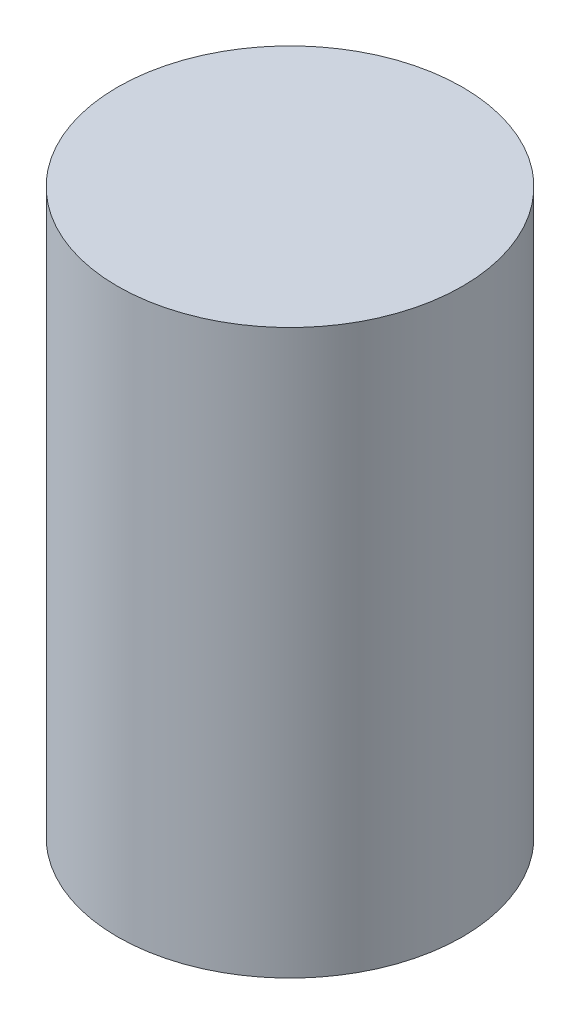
ISO-10303-21;
HEADER;
FILE_DESCRIPTION(('STEP AP214'),'2;1');
FILE_NAME('part.step','',(''),(''),'','','');
FILE_SCHEMA(('AUTOMOTIVE_DESIGN { 1 0 10303 214 1 1 1 1 }'));
ENDSEC;
DATA;
#1=APPLICATION_CONTEXT('core data for automotive mechanical design processes');
#2=APPLICATION_PROTOCOL_DEFINITION('international standard','automotive_design',2000,#1);
#3=PRODUCT_CONTEXT('',#1,'mechanical');
#4=PRODUCT('Part','Part','',(#3));
#5=PRODUCT_RELATED_PRODUCT_CATEGORY('part','',(#4));
#6=PRODUCT_DEFINITION_FORMATION('','',#4);
#7=PRODUCT_DEFINITION_CONTEXT('part definition',#1,'design');
#8=PRODUCT_DEFINITION('design','',#6,#7);
#9=PRODUCT_DEFINITION_SHAPE('','',#8);
#10=(LENGTH_UNIT() NAMED_UNIT(*) SI_UNIT(.MILLI.,.METRE.));
#11=(NAMED_UNIT(*) PLANE_ANGLE_UNIT() SI_UNIT($,.RADIAN.));
#12=(NAMED_UNIT(*) SI_UNIT($,.STERADIAN.) SOLID_ANGLE_UNIT());
#13=UNCERTAINTY_MEASURE_WITH_UNIT(LENGTH_MEASURE(1.E-05),#10,'distance_accuracy_value','');
#14=(GEOMETRIC_REPRESENTATION_CONTEXT(3) GLOBAL_UNCERTAINTY_ASSIGNED_CONTEXT((#13)) GLOBAL_UNIT_ASSIGNED_CONTEXT((#10,
#11,#12)) REPRESENTATION_CONTEXT('',''));
#15=CARTESIAN_POINT('',(0.,0.,0.));
#16=DIRECTION('',(0.,0.,1.));
#17=DIRECTION('',(1.,0.,0.));
#18=AXIS2_PLACEMENT_3D('',#15,#16,#17);
#19=CARTESIAN_POINT('',(0.,0.,0.));
#20=DIRECTION('',(0.,1.,0.));
#21=DIRECTION('',(0.,0.,1.));
#22=AXIS2_PLACEMENT_3D('',#19,#20,#21);
#23=PLANE('',#22);
#24=CARTESIAN_POINT('',(0.,0.,0.));
#25=DIRECTION('',(0.,1.,0.));
#26=DIRECTION('',(0.,0.,1.));
#27=AXIS2_PLACEMENT_3D('',#24,#25,#26);
#28=CIRCLE('',#27,75.);
#29=CARTESIAN_POINT('',(0.,0.,-75.));
#30=VERTEX_POINT('',#29);
#31=EDGE_CURVE('E10',#30,#30,#28,.T.);
#32=ORIENTED_EDGE('',*,*,#31,.F.);
#33=EDGE_LOOP('',(#32));
#34=FACE_BOUND('',#33,.T.);
#35=CARTESIAN_POINT('',(0.,0.,0.));
#36=DIRECTION('',(0.,1.,0.));
#37=DIRECTION('',(0.,0.,1.));
#38=AXIS2_PLACEMENT_3D('',#35,#36,#37);
#39=CIRCLE('',#38,60.);
#40=CARTESIAN_POINT('',(0.,0.,-60.));
#41=VERTEX_POINT('',#40);
#42=EDGE_CURVE('E39',#41,#41,#39,.T.);
#43=ORIENTED_EDGE('',*,*,#42,.T.);
#44=EDGE_LOOP('',(#43));
#45=FACE_BOUND('',#44,.T.);
#46=ADVANCED_FACE('F32',(#34,#45),#23,.F.);
#47=CARTESIAN_POINT('',(0.,215.,0.));
#48=DIRECTION('',(0.,-1.,0.));
#49=DIRECTION('',(0.,0.,-1.));
#50=AXIS2_PLACEMENT_3D('',#47,#48,#49);
#51=CYLINDRICAL_SURFACE('',#50,75.);
#52=CARTESIAN_POINT('',(0.,245.,0.));
#53=DIRECTION('',(0.,1.,0.));
#54=DIRECTION('',(0.,0.,1.));
#55=AXIS2_PLACEMENT_3D('',#52,#53,#54);
#56=CIRCLE('',#55,75.);
#57=CARTESIAN_POINT('',(0.,245.,-75.));
#58=VERTEX_POINT('',#57);
#59=EDGE_CURVE('E47',#58,#58,#56,.T.);
#60=CARTESIAN_POINT('',(0.,0.,-75.));
#61=CARTESIAN_POINT('',(0.,2.55208333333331,-75.));
#62=CARTESIAN_POINT('',(0.,5.10416666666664,-75.));
#63=CARTESIAN_POINT('',(0.,10.2083333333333,-75.));
#64=CARTESIAN_POINT('',(0.,12.7604166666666,-75.));
#65=CARTESIAN_POINT('',(0.,17.8645833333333,-75.));
#66=CARTESIAN_POINT('',(0.,20.4166666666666,-75.));
#67=CARTESIAN_POINT('',(0.,25.5208333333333,-75.));
#68=CARTESIAN_POINT('',(0.,28.0729166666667,-75.));
#69=CARTESIAN_POINT('',(0.,33.1770833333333,-75.));
#70=CARTESIAN_POINT('',(0.,35.7291666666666,-75.));
#71=CARTESIAN_POINT('',(0.,40.8333333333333,-75.));
#72=CARTESIAN_POINT('',(0.,43.3854166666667,-75.));
#73=CARTESIAN_POINT('',(0.,48.4895833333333,-75.));
#74=CARTESIAN_POINT('',(0.,51.0416666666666,-75.));
#75=CARTESIAN_POINT('',(0.,56.1458333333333,-75.));
#76=CARTESIAN_POINT('',(0.,58.6979166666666,-75.));
#77=CARTESIAN_POINT('',(0.,63.8020833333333,-75.));
#78=CARTESIAN_POINT('',(0.,66.3541666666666,-75.));
#79=CARTESIAN_POINT('',(0.,71.4583333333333,-75.));
#80=CARTESIAN_POINT('',(0.,74.0104166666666,-75.));
#81=CARTESIAN_POINT('',(0.,79.1145833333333,-75.));
#82=CARTESIAN_POINT('',(0.,81.6666666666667,-75.));
#83=CARTESIAN_POINT('',(0.,86.7708333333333,-75.));
#84=CARTESIAN_POINT('',(0.,89.3229166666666,-75.));
#85=CARTESIAN_POINT('',(0.,94.4270833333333,-75.));
#86=CARTESIAN_POINT('',(0.,96.9791666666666,-75.));
#87=CARTESIAN_POINT('',(0.,102.083333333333,-75.));
#88=CARTESIAN_POINT('',(0.,104.635416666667,-75.));
#89=CARTESIAN_POINT('',(0.,109.739583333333,-75.));
#90=CARTESIAN_POINT('',(0.,112.291666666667,-75.));
#91=CARTESIAN_POINT('',(0.,117.395833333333,-75.));
#92=CARTESIAN_POINT('',(0.,119.947916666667,-75.));
#93=CARTESIAN_POINT('',(0.,125.052083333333,-75.));
#94=CARTESIAN_POINT('',(0.,127.604166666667,-75.));
#95=CARTESIAN_POINT('',(0.,132.708333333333,-75.));
#96=CARTESIAN_POINT('',(0.,135.260416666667,-75.));
#97=CARTESIAN_POINT('',(0.,140.364583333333,-75.));
#98=CARTESIAN_POINT('',(0.,142.916666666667,-75.));
#99=CARTESIAN_POINT('',(0.,148.020833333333,-75.));
#100=CARTESIAN_POINT('',(0.,150.572916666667,-75.));
#101=CARTESIAN_POINT('',(0.,155.677083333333,-75.));
#102=CARTESIAN_POINT('',(0.,158.229166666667,-75.));
#103=CARTESIAN_POINT('',(0.,163.333333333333,-75.));
#104=CARTESIAN_POINT('',(0.,165.885416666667,-75.));
#105=CARTESIAN_POINT('',(0.,170.989583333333,-75.));
#106=CARTESIAN_POINT('',(0.,173.541666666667,-75.));
#107=CARTESIAN_POINT('',(0.,178.645833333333,-75.));
#108=CARTESIAN_POINT('',(0.,181.197916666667,-75.));
#109=CARTESIAN_POINT('',(0.,186.302083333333,-75.));
#110=CARTESIAN_POINT('',(0.,188.854166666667,-75.));
#111=CARTESIAN_POINT('',(0.,193.958333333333,-75.));
#112=CARTESIAN_POINT('',(0.,196.510416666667,-75.));
#113=CARTESIAN_POINT('',(0.,201.614583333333,-75.));
#114=CARTESIAN_POINT('',(0.,204.166666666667,-75.));
#115=CARTESIAN_POINT('',(0.,209.270833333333,-75.));
#116=CARTESIAN_POINT('',(0.,211.822916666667,-75.));
#117=CARTESIAN_POINT('',(0.,216.927083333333,-75.));
#118=CARTESIAN_POINT('',(0.,219.479166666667,-75.));
#119=CARTESIAN_POINT('',(0.,224.583333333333,-75.));
#120=CARTESIAN_POINT('',(0.,227.135416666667,-75.));
#121=CARTESIAN_POINT('',(0.,232.239583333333,-75.));
#122=CARTESIAN_POINT('',(0.,234.791666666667,-75.));
#123=CARTESIAN_POINT('',(0.,239.895833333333,-75.));
#124=CARTESIAN_POINT('',(0.,242.447916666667,-75.));
#125=CARTESIAN_POINT('',(0.,245.,-75.));
#126=B_SPLINE_CURVE_WITH_KNOTS('',3,(#60,#61,#62,#63,#64,#65,#66,#67,#68,#69,#70,#71,#72,#73,
#74,#75,#76,#77,#78,#79,#80,#81,#82,#83,#84,#85,#86,#87,#88,#89,#90,#91,#92,#93,#94,#95,#96,#97,
#98,#99,#100,#101,#102,#103,#104,#105,#106,#107,#108,#109,#110,#111,#112,#113,#114,#115,#116,
#117,#118,#119,#120,#121,#122,#123,#124,#125),.UNSPECIFIED.,.F.,.F.,(4,2,2,2,2,2,2,2,2,2,2,2,2,
2,2,2,2,2,2,2,2,2,2,2,2,2,2,2,2,2,2,2,4),(0.,7.65625,15.3125,22.96875,30.625,38.28125,45.9375,
53.59375,61.25,68.90625,76.5625,84.21875,91.875,99.53125,107.1875,114.84375,122.5,130.15625,
137.8125,145.46875,153.125,160.78125,168.4375,176.09375,183.75,191.40625,199.0625,206.71875,
214.375,222.03125,229.6875,237.34375,245.),.UNSPECIFIED.);
#127=EDGE_CURVE('BSEAM34',#30,#58,#126,.T.);
#128=ORIENTED_EDGE('',*,*,#31,.T.);
#129=ORIENTED_EDGE('',*,*,#59,.F.);
#130=ORIENTED_EDGE('',*,*,#127,.T.);
#131=ORIENTED_EDGE('',*,*,#127,.F.);
#132=EDGE_LOOP('',(#128,#130,#129,#131));
#133=FACE_BOUND('',#132,.T.);
#134=ADVANCED_FACE('F34',(#133),#51,.T.);
#135=CARTESIAN_POINT('',(0.,215.,0.));
#136=DIRECTION('',(0.,-1.,0.));
#137=DIRECTION('',(0.,0.,-1.));
#138=AXIS2_PLACEMENT_3D('',#135,#136,#137);
#139=CYLINDRICAL_SURFACE('',#138,60.);
#140=CARTESIAN_POINT('',(0.,215.,0.));
#141=DIRECTION('',(0.,1.,0.));
#142=DIRECTION('',(0.,0.,1.));
#143=AXIS2_PLACEMENT_3D('',#140,#141,#142);
#144=CIRCLE('',#143,60.);
#145=CARTESIAN_POINT('',(0.,215.,-60.));
#146=VERTEX_POINT('',#145);
#147=EDGE_CURVE('E43',#146,#146,#144,.T.);
#148=CARTESIAN_POINT('',(0.,215.,-60.));
#149=CARTESIAN_POINT('',(0.,212.760416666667,-60.));
#150=CARTESIAN_POINT('',(0.,210.520833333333,-60.));
#151=CARTESIAN_POINT('',(0.,206.041666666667,-60.));
#152=CARTESIAN_POINT('',(0.,203.802083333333,-60.));
#153=CARTESIAN_POINT('',(0.,199.322916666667,-60.));
#154=CARTESIAN_POINT('',(0.,197.083333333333,-60.));
#155=CARTESIAN_POINT('',(0.,192.604166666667,-60.));
#156=CARTESIAN_POINT('',(0.,190.364583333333,-60.));
#157=CARTESIAN_POINT('',(0.,185.885416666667,-60.));
#158=CARTESIAN_POINT('',(0.,183.645833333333,-60.));
#159=CARTESIAN_POINT('',(0.,179.166666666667,-60.));
#160=CARTESIAN_POINT('',(0.,176.927083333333,-60.));
#161=CARTESIAN_POINT('',(0.,172.447916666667,-60.));
#162=CARTESIAN_POINT('',(0.,170.208333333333,-60.));
#163=CARTESIAN_POINT('',(0.,165.729166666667,-60.));
#164=CARTESIAN_POINT('',(0.,163.489583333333,-60.));
#165=CARTESIAN_POINT('',(0.,159.010416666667,-60.));
#166=CARTESIAN_POINT('',(0.,156.770833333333,-60.));
#167=CARTESIAN_POINT('',(0.,152.291666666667,-60.));
#168=CARTESIAN_POINT('',(0.,150.052083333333,-60.));
#169=CARTESIAN_POINT('',(0.,145.572916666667,-60.));
#170=CARTESIAN_POINT('',(0.,143.333333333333,-60.));
#171=CARTESIAN_POINT('',(0.,138.854166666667,-60.));
#172=CARTESIAN_POINT('',(0.,136.614583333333,-60.));
#173=CARTESIAN_POINT('',(0.,132.135416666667,-60.));
#174=CARTESIAN_POINT('',(0.,129.895833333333,-60.));
#175=CARTESIAN_POINT('',(0.,125.416666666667,-60.));
#176=CARTESIAN_POINT('',(0.,123.177083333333,-60.));
#177=CARTESIAN_POINT('',(0.,118.697916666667,-60.));
#178=CARTESIAN_POINT('',(0.,116.458333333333,-60.));
#179=CARTESIAN_POINT('',(0.,111.979166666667,-60.));
#180=CARTESIAN_POINT('',(0.,109.739583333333,-60.));
#181=CARTESIAN_POINT('',(0.,105.260416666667,-60.));
#182=CARTESIAN_POINT('',(0.,103.020833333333,-60.));
#183=CARTESIAN_POINT('',(0.,98.5416666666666,-60.));
#184=CARTESIAN_POINT('',(0.,96.3020833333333,-60.));
#185=CARTESIAN_POINT('',(0.,91.8229166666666,-60.));
#186=CARTESIAN_POINT('',(0.,89.5833333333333,-60.));
#187=CARTESIAN_POINT('',(0.,85.1041666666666,-60.));
#188=CARTESIAN_POINT('',(0.,82.8645833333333,-60.));
#189=CARTESIAN_POINT('',(0.,78.3854166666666,-60.));
#190=CARTESIAN_POINT('',(0.,76.1458333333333,-60.));
#191=CARTESIAN_POINT('',(0.,71.6666666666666,-60.));
#192=CARTESIAN_POINT('',(0.,69.4270833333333,-60.));
#193=CARTESIAN_POINT('',(0.,64.9479166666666,-60.));
#194=CARTESIAN_POINT('',(0.,62.7083333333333,-60.));
#195=CARTESIAN_POINT('',(0.,58.2291666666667,-60.));
#196=CARTESIAN_POINT('',(0.,55.9895833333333,-60.));
#197=CARTESIAN_POINT('',(0.,51.5104166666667,-60.));
#198=CARTESIAN_POINT('',(0.,49.2708333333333,-60.));
#199=CARTESIAN_POINT('',(0.,44.7916666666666,-60.));
#200=CARTESIAN_POINT('',(0.,42.5520833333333,-60.));
#201=CARTESIAN_POINT('',(0.,38.0729166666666,-60.));
#202=CARTESIAN_POINT('',(0.,35.8333333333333,-60.));
#203=CARTESIAN_POINT('',(0.,31.3541666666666,-60.));
#204=CARTESIAN_POINT('',(0.,29.1145833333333,-60.));
#205=CARTESIAN_POINT('',(0.,24.6354166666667,-60.));
#206=CARTESIAN_POINT('',(0.,22.3958333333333,-60.));
#207=CARTESIAN_POINT('',(0.,17.9166666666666,-60.));
#208=CARTESIAN_POINT('',(0.,15.6770833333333,-60.));
#209=CARTESIAN_POINT('',(0.,11.1979166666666,-60.));
#210=CARTESIAN_POINT('',(0.,8.9583333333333,-60.));
#211=CARTESIAN_POINT('',(0.,4.47916666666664,-60.));
#212=CARTESIAN_POINT('',(0.,2.23958333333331,-60.));
#213=CARTESIAN_POINT('',(0.,0.,-60.));
#214=B_SPLINE_CURVE_WITH_KNOTS('',3,(#148,#149,#150,#151,#152,#153,#154,#155,#156,#157,#158,
#159,#160,#161,#162,#163,#164,#165,#166,#167,#168,#169,#170,#171,#172,#173,#174,#175,#176,#177,
#178,#179,#180,#181,#182,#183,#184,#185,#186,#187,#188,#189,#190,#191,#192,#193,#194,#195,#196,
#197,#198,#199,#200,#201,#202,#203,#204,#205,#206,#207,#208,#209,#210,#211,#212,#213),
.UNSPECIFIED.,.F.,.F.,(4,2,2,2,2,2,2,2,2,2,2,2,2,2,2,2,2,2,2,2,2,2,2,2,2,2,2,2,2,2,2,2,4),(0.,
6.71875000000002,13.4375,20.15625,26.875,33.59375,40.3125,47.03125,53.75,60.46875,67.1875,
73.90625,80.625,87.34375,94.0625,100.78125,107.5,114.21875,120.9375,127.65625,134.375,141.09375,
147.8125,154.53125,161.25,167.96875,174.6875,181.40625,188.125,194.84375,201.5625,208.28125,
215.),.UNSPECIFIED.);
#215=EDGE_CURVE('BSEAM56',#146,#41,#214,.T.);
#216=ORIENTED_EDGE('',*,*,#147,.T.);
#217=ORIENTED_EDGE('',*,*,#42,.F.);
#218=ORIENTED_EDGE('',*,*,#215,.T.);
#219=ORIENTED_EDGE('',*,*,#215,.F.);
#220=EDGE_LOOP('',(#216,#218,#217,#219));
#221=FACE_BOUND('',#220,.T.);
#222=ADVANCED_FACE('F56',(#221),#139,.F.);
#223=CARTESIAN_POINT('',(0.,215.,0.));
#224=DIRECTION('',(0.,1.,0.));
#225=DIRECTION('',(0.,0.,1.));
#226=AXIS2_PLACEMENT_3D('',#223,#224,#225);
#227=PLANE('',#226);
#228=ORIENTED_EDGE('',*,*,#147,.F.);
#229=EDGE_LOOP('',(#228));
#230=FACE_BOUND('',#229,.T.);
#231=ADVANCED_FACE('F61',(#230),#227,.F.);
#232=CARTESIAN_POINT('',(0.,245.,0.));
#233=DIRECTION('',(0.,1.,0.));
#234=DIRECTION('',(0.,0.,1.));
#235=AXIS2_PLACEMENT_3D('',#232,#233,#234);
#236=PLANE('',#235);
#237=ORIENTED_EDGE('',*,*,#59,.T.);
#238=EDGE_LOOP('',(#237));
#239=FACE_BOUND('',#238,.T.);
#240=ADVANCED_FACE('F53',(#239),#236,.T.);
#241=CLOSED_SHELL('',(#46,#134,#222,#231,#240));
#242=MANIFOLD_SOLID_BREP('B2',#241);
#243=ADVANCED_BREP_SHAPE_REPRESENTATION('',(#18,#242),#14);
#244=SHAPE_DEFINITION_REPRESENTATION(#9,#243);
ENDSEC;
END-ISO-10303-21;
